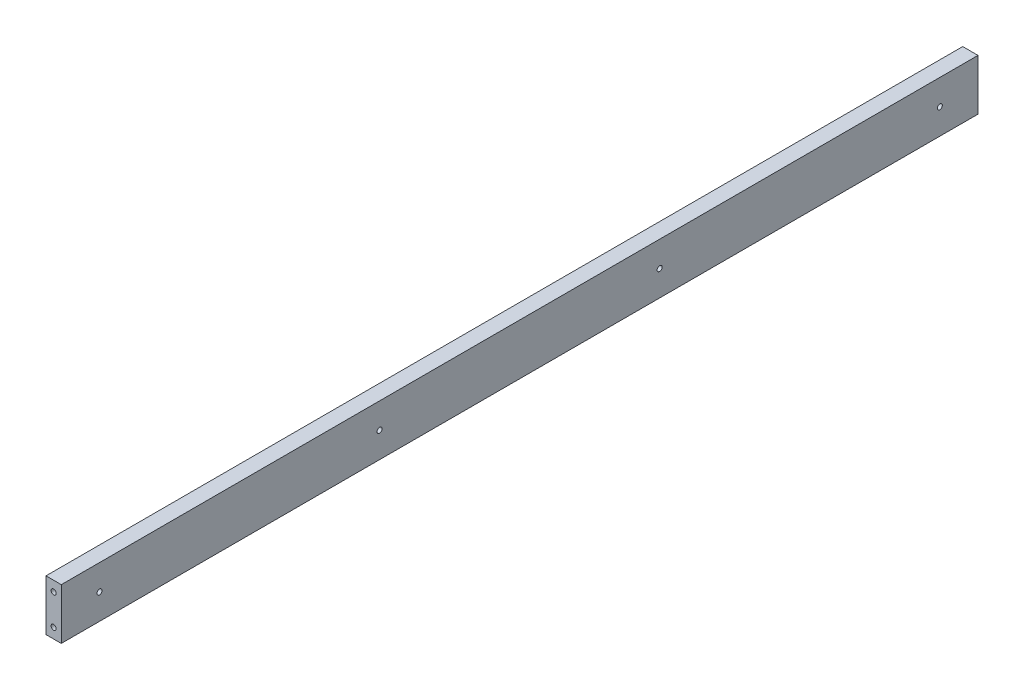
ISO-10303-21;
HEADER;
FILE_DESCRIPTION(('STEP AP214'),'2;1');
FILE_NAME('part.step','',(''),(''),'','','');
FILE_SCHEMA(('AUTOMOTIVE_DESIGN { 1 0 10303 214 1 1 1 1 }'));
ENDSEC;
DATA;
#1=APPLICATION_CONTEXT('core data for automotive mechanical design processes');
#2=APPLICATION_PROTOCOL_DEFINITION('international standard','automotive_design',2000,#1);
#3=PRODUCT_CONTEXT('',#1,'mechanical');
#4=PRODUCT('Part','Part','',(#3));
#5=PRODUCT_RELATED_PRODUCT_CATEGORY('part','',(#4));
#6=PRODUCT_DEFINITION_FORMATION('','',#4);
#7=PRODUCT_DEFINITION_CONTEXT('part definition',#1,'design');
#8=PRODUCT_DEFINITION('design','',#6,#7);
#9=PRODUCT_DEFINITION_SHAPE('','',#8);
#10=(LENGTH_UNIT() NAMED_UNIT(*) SI_UNIT(.MILLI.,.METRE.));
#11=(NAMED_UNIT(*) PLANE_ANGLE_UNIT() SI_UNIT($,.RADIAN.));
#12=(NAMED_UNIT(*) SI_UNIT($,.STERADIAN.) SOLID_ANGLE_UNIT());
#13=UNCERTAINTY_MEASURE_WITH_UNIT(LENGTH_MEASURE(1.E-05),#10,'distance_accuracy_value','');
#14=(GEOMETRIC_REPRESENTATION_CONTEXT(3) GLOBAL_UNCERTAINTY_ASSIGNED_CONTEXT((#13)) GLOBAL_UNIT_ASSIGNED_CONTEXT((#10,
#11,#12)) REPRESENTATION_CONTEXT('',''));
#15=CARTESIAN_POINT('',(0.,0.,0.));
#16=DIRECTION('',(0.,0.,1.));
#17=DIRECTION('',(1.,0.,0.));
#18=AXIS2_PLACEMENT_3D('',#15,#16,#17);
#19=CARTESIAN_POINT('',(0.,0.,-450.));
#20=DIRECTION('',(-1.,0.,0.));
#21=DIRECTION('',(0.,0.,1.));
#22=AXIS2_PLACEMENT_3D('',#19,#20,#21);
#23=PLANE('',#22);
#24=CARTESIAN_POINT('',(0.,25.,-137.5));
#25=DIRECTION('',(1.,0.,0.));
#26=DIRECTION('',(0.,0.,-1.));
#27=AXIS2_PLACEMENT_3D('',#24,#25,#26);
#28=CIRCLE('',#27,2.5);
#29=CARTESIAN_POINT('',(0.,25.,-140.));
#30=VERTEX_POINT('',#29);
#31=EDGE_CURVE('E207',#30,#30,#28,.T.);
#32=ORIENTED_EDGE('',*,*,#31,.T.);
#33=EDGE_LOOP('',(#32));
#34=FACE_BOUND('',#33,.T.);
#35=CARTESIAN_POINT('',(0.,25.,412.5));
#36=DIRECTION('',(1.,0.,0.));
#37=DIRECTION('',(0.,0.,-1.));
#38=AXIS2_PLACEMENT_3D('',#35,#36,#37);
#39=CIRCLE('',#38,2.5);
#40=CARTESIAN_POINT('',(0.,25.,410.));
#41=VERTEX_POINT('',#40);
#42=EDGE_CURVE('E211',#41,#41,#39,.T.);
#43=ORIENTED_EDGE('',*,*,#42,.T.);
#44=EDGE_LOOP('',(#43));
#45=FACE_BOUND('',#44,.T.);
#46=CARTESIAN_POINT('',(0.,25.,137.5));
#47=DIRECTION('',(1.,0.,0.));
#48=DIRECTION('',(0.,0.,-1.));
#49=AXIS2_PLACEMENT_3D('',#46,#47,#48);
#50=CIRCLE('',#49,2.5);
#51=CARTESIAN_POINT('',(0.,25.,135.));
#52=VERTEX_POINT('',#51);
#53=EDGE_CURVE('E215',#52,#52,#50,.T.);
#54=ORIENTED_EDGE('',*,*,#53,.T.);
#55=EDGE_LOOP('',(#54));
#56=FACE_BOUND('',#55,.T.);
#57=CARTESIAN_POINT('',(0.,25.,-412.5));
#58=DIRECTION('',(1.,0.,0.));
#59=DIRECTION('',(0.,0.,-1.));
#60=AXIS2_PLACEMENT_3D('',#57,#58,#59);
#61=CIRCLE('',#60,2.5);
#62=CARTESIAN_POINT('',(0.,25.,-415.));
#63=VERTEX_POINT('',#62);
#64=EDGE_CURVE('E116',#63,#63,#61,.T.);
#65=ORIENTED_EDGE('',*,*,#64,.T.);
#66=EDGE_LOOP('',(#65));
#67=FACE_BOUND('',#66,.T.);
#68=DIRECTION('',(0.,-1.,0.));
#69=VECTOR('',#68,1.);
#70=CARTESIAN_POINT('',(0.,0.,450.));
#71=LINE('',#70,#69);
#72=CARTESIAN_POINT('',(0.,50.,450.));
#73=VERTEX_POINT('',#72);
#74=CARTESIAN_POINT('',(0.,0.,450.));
#75=VERTEX_POINT('',#74);
#76=EDGE_CURVE('E143',#73,#75,#71,.T.);
#77=ORIENTED_EDGE('',*,*,#76,.F.);
#78=DIRECTION('',(0.,0.,1.));
#79=VECTOR('',#78,1.);
#80=CARTESIAN_POINT('',(0.,50.,-450.));
#81=LINE('',#80,#79);
#82=CARTESIAN_POINT('',(0.,50.,-450.));
#83=VERTEX_POINT('',#82);
#84=EDGE_CURVE('E11',#83,#73,#81,.T.);
#85=ORIENTED_EDGE('',*,*,#84,.F.);
#86=DIRECTION('',(0.,-1.,0.));
#87=VECTOR('',#86,1.);
#88=CARTESIAN_POINT('',(0.,0.,-450.));
#89=LINE('',#88,#87);
#90=CARTESIAN_POINT('',(0.,0.,-450.));
#91=VERTEX_POINT('',#90);
#92=EDGE_CURVE('E159',#83,#91,#89,.T.);
#93=ORIENTED_EDGE('',*,*,#92,.T.);
#94=DIRECTION('',(0.,0.,1.));
#95=VECTOR('',#94,1.);
#96=CARTESIAN_POINT('',(0.,0.,-450.));
#97=LINE('',#96,#95);
#98=EDGE_CURVE('E45',#91,#75,#97,.T.);
#99=ORIENTED_EDGE('',*,*,#98,.T.);
#100=EDGE_LOOP('',(#77,#85,#93,#99));
#101=FACE_BOUND('',#100,.T.);
#102=ADVANCED_FACE('F42',(#34,#45,#56,#67,#101),#23,.T.);
#103=CARTESIAN_POINT('',(0.,50.,-450.));
#104=DIRECTION('',(0.,1.,0.));
#105=DIRECTION('',(0.,0.,1.));
#106=AXIS2_PLACEMENT_3D('',#103,#104,#105);
#107=PLANE('',#106);
#108=DIRECTION('',(-1.,0.,0.));
#109=VECTOR('',#108,1.);
#110=CARTESIAN_POINT('',(0.,50.,450.));
#111=LINE('',#110,#109);
#112=CARTESIAN_POINT('',(15.,50.,450.));
#113=VERTEX_POINT('',#112);
#114=EDGE_CURVE('E155',#113,#73,#111,.T.);
#115=ORIENTED_EDGE('',*,*,#114,.F.);
#116=DIRECTION('',(0.,0.,1.));
#117=VECTOR('',#116,1.);
#118=CARTESIAN_POINT('',(15.,50.,-450.));
#119=LINE('',#118,#117);
#120=CARTESIAN_POINT('',(15.,50.,-450.));
#121=VERTEX_POINT('',#120);
#122=EDGE_CURVE('E51',#121,#113,#119,.T.);
#123=ORIENTED_EDGE('',*,*,#122,.F.);
#124=DIRECTION('',(-1.,0.,0.));
#125=VECTOR('',#124,1.);
#126=CARTESIAN_POINT('',(0.,50.,-450.));
#127=LINE('',#126,#125);
#128=EDGE_CURVE('E169',#121,#83,#127,.T.);
#129=ORIENTED_EDGE('',*,*,#128,.T.);
#130=ORIENTED_EDGE('',*,*,#84,.T.);
#131=EDGE_LOOP('',(#115,#123,#129,#130));
#132=FACE_BOUND('',#131,.T.);
#133=ADVANCED_FACE('F183',(#132),#107,.T.);
#134=CARTESIAN_POINT('',(15.,0.,-450.));
#135=DIRECTION('',(1.,0.,0.));
#136=DIRECTION('',(0.,0.,-1.));
#137=AXIS2_PLACEMENT_3D('',#134,#135,#136);
#138=PLANE('',#137);
#139=CARTESIAN_POINT('',(15.,25.,-137.5));
#140=DIRECTION('',(1.,0.,0.));
#141=DIRECTION('',(0.,0.,-1.));
#142=AXIS2_PLACEMENT_3D('',#139,#140,#141);
#143=CIRCLE('',#142,2.49999999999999);
#144=CARTESIAN_POINT('',(15.,25.,-140.));
#145=VERTEX_POINT('',#144);
#146=EDGE_CURVE('E232',#145,#145,#143,.T.);
#147=ORIENTED_EDGE('',*,*,#146,.F.);
#148=EDGE_LOOP('',(#147));
#149=FACE_BOUND('',#148,.T.);
#150=CARTESIAN_POINT('',(15.,25.,412.5));
#151=DIRECTION('',(1.,0.,0.));
#152=DIRECTION('',(0.,0.,-1.));
#153=AXIS2_PLACEMENT_3D('',#150,#151,#152);
#154=CIRCLE('',#153,2.49999999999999);
#155=CARTESIAN_POINT('',(15.,25.,410.));
#156=VERTEX_POINT('',#155);
#157=EDGE_CURVE('E228',#156,#156,#154,.T.);
#158=ORIENTED_EDGE('',*,*,#157,.F.);
#159=EDGE_LOOP('',(#158));
#160=FACE_BOUND('',#159,.T.);
#161=CARTESIAN_POINT('',(15.,25.,137.5));
#162=DIRECTION('',(1.,0.,0.));
#163=DIRECTION('',(0.,0.,-1.));
#164=AXIS2_PLACEMENT_3D('',#161,#162,#163);
#165=CIRCLE('',#164,2.49999999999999);
#166=CARTESIAN_POINT('',(15.,25.,135.));
#167=VERTEX_POINT('',#166);
#168=EDGE_CURVE('E220',#167,#167,#165,.T.);
#169=ORIENTED_EDGE('',*,*,#168,.F.);
#170=EDGE_LOOP('',(#169));
#171=FACE_BOUND('',#170,.T.);
#172=CARTESIAN_POINT('',(15.,25.,-412.5));
#173=DIRECTION('',(1.,0.,0.));
#174=DIRECTION('',(0.,0.,-1.));
#175=AXIS2_PLACEMENT_3D('',#172,#173,#174);
#176=CIRCLE('',#175,2.49999999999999);
#177=CARTESIAN_POINT('',(15.,25.,-415.));
#178=VERTEX_POINT('',#177);
#179=EDGE_CURVE('E106',#178,#178,#176,.T.);
#180=ORIENTED_EDGE('',*,*,#179,.F.);
#181=EDGE_LOOP('',(#180));
#182=FACE_BOUND('',#181,.T.);
#183=DIRECTION('',(0.,1.,0.));
#184=VECTOR('',#183,1.);
#185=CARTESIAN_POINT('',(15.,0.,450.));
#186=LINE('',#185,#184);
#187=CARTESIAN_POINT('',(15.,0.,450.));
#188=VERTEX_POINT('',#187);
#189=EDGE_CURVE('E151',#188,#113,#186,.T.);
#190=ORIENTED_EDGE('',*,*,#189,.F.);
#191=DIRECTION('',(0.,0.,1.));
#192=VECTOR('',#191,1.);
#193=CARTESIAN_POINT('',(15.,0.,-450.));
#194=LINE('',#193,#192);
#195=CARTESIAN_POINT('',(15.,0.,-450.));
#196=VERTEX_POINT('',#195);
#197=EDGE_CURVE('E172',#196,#188,#194,.T.);
#198=ORIENTED_EDGE('',*,*,#197,.F.);
#199=DIRECTION('',(0.,1.,0.));
#200=VECTOR('',#199,1.);
#201=CARTESIAN_POINT('',(15.,0.,-450.));
#202=LINE('',#201,#200);
#203=EDGE_CURVE('E166',#196,#121,#202,.T.);
#204=ORIENTED_EDGE('',*,*,#203,.T.);
#205=ORIENTED_EDGE('',*,*,#122,.T.);
#206=EDGE_LOOP('',(#190,#198,#204,#205));
#207=FACE_BOUND('',#206,.T.);
#208=ADVANCED_FACE('F189',(#149,#160,#171,#182,#207),#138,.T.);
#209=CARTESIAN_POINT('',(0.,0.,-450.));
#210=DIRECTION('',(0.,-1.,0.));
#211=DIRECTION('',(0.,0.,-1.));
#212=AXIS2_PLACEMENT_3D('',#209,#210,#211);
#213=PLANE('',#212);
#214=DIRECTION('',(1.,0.,0.));
#215=VECTOR('',#214,1.);
#216=CARTESIAN_POINT('',(0.,0.,450.));
#217=LINE('',#216,#215);
#218=EDGE_CURVE('E147',#75,#188,#217,.T.);
#219=ORIENTED_EDGE('',*,*,#218,.F.);
#220=ORIENTED_EDGE('',*,*,#98,.F.);
#221=DIRECTION('',(1.,0.,0.));
#222=VECTOR('',#221,1.);
#223=CARTESIAN_POINT('',(0.,0.,-450.));
#224=LINE('',#223,#222);
#225=EDGE_CURVE('E162',#91,#196,#224,.T.);
#226=ORIENTED_EDGE('',*,*,#225,.T.);
#227=ORIENTED_EDGE('',*,*,#197,.T.);
#228=EDGE_LOOP('',(#219,#220,#226,#227));
#229=FACE_BOUND('',#228,.T.);
#230=ADVANCED_FACE('F180',(#229),#213,.T.);
#231=CARTESIAN_POINT('',(0.,50.,-450.));
#232=DIRECTION('',(0.,0.,-1.));
#233=DIRECTION('',(-1.,0.,0.));
#234=AXIS2_PLACEMENT_3D('',#231,#232,#233);
#235=PLANE('',#234);
#236=CARTESIAN_POINT('',(7.5,40.,-450.));
#237=DIRECTION('',(0.,0.,-1.));
#238=DIRECTION('',(-1.,0.,0.));
#239=AXIS2_PLACEMENT_3D('',#236,#237,#238);
#240=CIRCLE('',#239,2.5);
#241=CARTESIAN_POINT('',(5.,40.,-450.));
#242=VERTEX_POINT('',#241);
#243=EDGE_CURVE('E105',#242,#242,#240,.T.);
#244=ORIENTED_EDGE('',*,*,#243,.F.);
#245=EDGE_LOOP('',(#244));
#246=FACE_BOUND('',#245,.T.);
#247=CARTESIAN_POINT('',(7.5,10.,-450.));
#248=DIRECTION('',(0.,0.,-1.));
#249=DIRECTION('',(-1.,0.,0.));
#250=AXIS2_PLACEMENT_3D('',#247,#248,#249);
#251=CIRCLE('',#250,2.5);
#252=CARTESIAN_POINT('',(5.,10.,-450.));
#253=VERTEX_POINT('',#252);
#254=EDGE_CURVE('E123',#253,#253,#251,.T.);
#255=ORIENTED_EDGE('',*,*,#254,.F.);
#256=EDGE_LOOP('',(#255));
#257=FACE_BOUND('',#256,.T.);
#258=ORIENTED_EDGE('',*,*,#92,.F.);
#259=ORIENTED_EDGE('',*,*,#128,.F.);
#260=ORIENTED_EDGE('',*,*,#203,.F.);
#261=ORIENTED_EDGE('',*,*,#225,.F.);
#262=EDGE_LOOP('',(#258,#259,#260,#261));
#263=FACE_BOUND('',#262,.T.);
#264=ADVANCED_FACE('F187',(#246,#257,#263),#235,.T.);
#265=CARTESIAN_POINT('',(0.,50.,450.));
#266=DIRECTION('',(0.,0.,-1.));
#267=DIRECTION('',(-1.,0.,0.));
#268=AXIS2_PLACEMENT_3D('',#265,#266,#267);
#269=PLANE('',#268);
#270=CARTESIAN_POINT('',(7.5,40.,450.));
#271=DIRECTION('',(0.,0.,1.));
#272=DIRECTION('',(1.,0.,0.));
#273=AXIS2_PLACEMENT_3D('',#270,#271,#272);
#274=CIRCLE('',#273,2.5);
#275=CARTESIAN_POINT('',(10.,40.,450.));
#276=VERTEX_POINT('',#275);
#277=EDGE_CURVE('E131',#276,#276,#274,.T.);
#278=ORIENTED_EDGE('',*,*,#277,.F.);
#279=EDGE_LOOP('',(#278));
#280=FACE_BOUND('',#279,.T.);
#281=CARTESIAN_POINT('',(7.5,10.,450.));
#282=DIRECTION('',(0.,0.,1.));
#283=DIRECTION('',(1.,0.,0.));
#284=AXIS2_PLACEMENT_3D('',#281,#282,#283);
#285=CIRCLE('',#284,2.5);
#286=CARTESIAN_POINT('',(10.,10.,450.));
#287=VERTEX_POINT('',#286);
#288=EDGE_CURVE('E139',#287,#287,#285,.T.);
#289=ORIENTED_EDGE('',*,*,#288,.F.);
#290=EDGE_LOOP('',(#289));
#291=FACE_BOUND('',#290,.T.);
#292=ORIENTED_EDGE('',*,*,#76,.T.);
#293=ORIENTED_EDGE('',*,*,#218,.T.);
#294=ORIENTED_EDGE('',*,*,#189,.T.);
#295=ORIENTED_EDGE('',*,*,#114,.T.);
#296=EDGE_LOOP('',(#292,#293,#294,#295));
#297=FACE_BOUND('',#296,.T.);
#298=ADVANCED_FACE('F182',(#280,#291,#297),#269,.F.);
#299=CARTESIAN_POINT('',(7.5,10.,450.));
#300=DIRECTION('',(0.,0.,1.));
#301=DIRECTION('',(1.,0.,0.));
#302=AXIS2_PLACEMENT_3D('',#299,#300,#301);
#303=CYLINDRICAL_SURFACE('',#302,2.5);
#304=CARTESIAN_POINT('',(7.5,10.,434.));
#305=DIRECTION('',(0.,0.,1.));
#306=DIRECTION('',(1.,0.,0.));
#307=AXIS2_PLACEMENT_3D('',#304,#305,#306);
#308=CIRCLE('',#307,2.5);
#309=CARTESIAN_POINT('',(9.99999999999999,10.,434.));
#310=VERTEX_POINT('',#309);
#311=EDGE_CURVE('E135',#310,#310,#308,.T.);
#312=ORIENTED_EDGE('',*,*,#311,.F.);
#313=EDGE_LOOP('',(#312));
#314=FACE_BOUND('',#313,.T.);
#315=ORIENTED_EDGE('',*,*,#288,.T.);
#316=EDGE_LOOP('',(#315));
#317=FACE_BOUND('',#316,.T.);
#318=ADVANCED_FACE('F275',(#314,#317),#303,.F.);
#319=CARTESIAN_POINT('',(7.5,10.,434.));
#320=DIRECTION('',(0.,0.,1.));
#321=DIRECTION('',(1.,0.,0.));
#322=AXIS2_PLACEMENT_3D('',#319,#320,#321);
#323=CONICAL_SURFACE('',#322,2.5,1.02974425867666);
#324=CARTESIAN_POINT('',(7.49999999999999,10.,432.497848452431));
#325=VERTEX_POINT('',#324);
#326=VERTEX_LOOP('',#325);
#327=FACE_BOUND('',#326,.T.);
#328=ORIENTED_EDGE('',*,*,#311,.T.);
#329=EDGE_LOOP('',(#328));
#330=FACE_BOUND('',#329,.T.);
#331=ADVANCED_FACE('F271',(#327,#330),#323,.F.);
#332=CARTESIAN_POINT('',(7.5,40.,450.));
#333=DIRECTION('',(0.,0.,1.));
#334=DIRECTION('',(1.,0.,0.));
#335=AXIS2_PLACEMENT_3D('',#332,#333,#334);
#336=CYLINDRICAL_SURFACE('',#335,2.5);
#337=CARTESIAN_POINT('',(7.5,40.,434.));
#338=DIRECTION('',(0.,0.,1.));
#339=DIRECTION('',(1.,0.,0.));
#340=AXIS2_PLACEMENT_3D('',#337,#338,#339);
#341=CIRCLE('',#340,2.5);
#342=CARTESIAN_POINT('',(9.99999999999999,40.,434.));
#343=VERTEX_POINT('',#342);
#344=EDGE_CURVE('E127',#343,#343,#341,.T.);
#345=ORIENTED_EDGE('',*,*,#344,.F.);
#346=EDGE_LOOP('',(#345));
#347=FACE_BOUND('',#346,.T.);
#348=ORIENTED_EDGE('',*,*,#277,.T.);
#349=EDGE_LOOP('',(#348));
#350=FACE_BOUND('',#349,.T.);
#351=ADVANCED_FACE('F267',(#347,#350),#336,.F.);
#352=CARTESIAN_POINT('',(7.5,40.,434.));
#353=DIRECTION('',(0.,0.,1.));
#354=DIRECTION('',(1.,0.,0.));
#355=AXIS2_PLACEMENT_3D('',#352,#353,#354);
#356=CONICAL_SURFACE('',#355,2.5,1.02974425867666);
#357=CARTESIAN_POINT('',(7.49999999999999,40.,432.497848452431));
#358=VERTEX_POINT('',#357);
#359=VERTEX_LOOP('',#358);
#360=FACE_BOUND('',#359,.T.);
#361=ORIENTED_EDGE('',*,*,#344,.T.);
#362=EDGE_LOOP('',(#361));
#363=FACE_BOUND('',#362,.T.);
#364=ADVANCED_FACE('F263',(#360,#363),#356,.F.);
#365=CARTESIAN_POINT('',(7.5,10.,-450.));
#366=DIRECTION('',(0.,0.,-1.));
#367=DIRECTION('',(-1.,0.,0.));
#368=AXIS2_PLACEMENT_3D('',#365,#366,#367);
#369=CYLINDRICAL_SURFACE('',#368,2.5);
#370=CARTESIAN_POINT('',(7.5,10.,-434.));
#371=DIRECTION('',(0.,0.,-1.));
#372=DIRECTION('',(-1.,0.,0.));
#373=AXIS2_PLACEMENT_3D('',#370,#371,#372);
#374=CIRCLE('',#373,2.5);
#375=CARTESIAN_POINT('',(5.,10.,-434.));
#376=VERTEX_POINT('',#375);
#377=EDGE_CURVE('E112',#376,#376,#374,.T.);
#378=ORIENTED_EDGE('',*,*,#377,.F.);
#379=EDGE_LOOP('',(#378));
#380=FACE_BOUND('',#379,.T.);
#381=ORIENTED_EDGE('',*,*,#254,.T.);
#382=EDGE_LOOP('',(#381));
#383=FACE_BOUND('',#382,.T.);
#384=ADVANCED_FACE('F259',(#380,#383),#369,.F.);
#385=CARTESIAN_POINT('',(7.5,10.,-434.));
#386=DIRECTION('',(0.,0.,-1.));
#387=DIRECTION('',(-1.,0.,0.));
#388=AXIS2_PLACEMENT_3D('',#385,#386,#387);
#389=CONICAL_SURFACE('',#388,2.5,1.02974425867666);
#390=CARTESIAN_POINT('',(7.49999999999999,10.,-432.497848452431));
#391=VERTEX_POINT('',#390);
#392=VERTEX_LOOP('',#391);
#393=FACE_BOUND('',#392,.T.);
#394=ORIENTED_EDGE('',*,*,#377,.T.);
#395=EDGE_LOOP('',(#394));
#396=FACE_BOUND('',#395,.T.);
#397=ADVANCED_FACE('F256',(#393,#396),#389,.F.);
#398=CARTESIAN_POINT('',(7.5,40.,-450.));
#399=DIRECTION('',(0.,0.,-1.));
#400=DIRECTION('',(-1.,0.,0.));
#401=AXIS2_PLACEMENT_3D('',#398,#399,#400);
#402=CYLINDRICAL_SURFACE('',#401,2.5);
#403=CARTESIAN_POINT('',(7.5,40.,-434.));
#404=DIRECTION('',(0.,0.,-1.));
#405=DIRECTION('',(-1.,0.,0.));
#406=AXIS2_PLACEMENT_3D('',#403,#404,#405);
#407=CIRCLE('',#406,2.5);
#408=CARTESIAN_POINT('',(5.,40.,-434.));
#409=VERTEX_POINT('',#408);
#410=EDGE_CURVE('E102',#409,#409,#407,.T.);
#411=ORIENTED_EDGE('',*,*,#410,.F.);
#412=EDGE_LOOP('',(#411));
#413=FACE_BOUND('',#412,.T.);
#414=ORIENTED_EDGE('',*,*,#243,.T.);
#415=EDGE_LOOP('',(#414));
#416=FACE_BOUND('',#415,.T.);
#417=ADVANCED_FACE('F98',(#413,#416),#402,.F.);
#418=CARTESIAN_POINT('',(7.5,40.,-434.));
#419=DIRECTION('',(0.,0.,-1.));
#420=DIRECTION('',(-1.,0.,0.));
#421=AXIS2_PLACEMENT_3D('',#418,#419,#420);
#422=CONICAL_SURFACE('',#421,2.5,1.02974425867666);
#423=CARTESIAN_POINT('',(7.49999999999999,40.,-432.497848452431));
#424=VERTEX_POINT('',#423);
#425=VERTEX_LOOP('',#424);
#426=FACE_BOUND('',#425,.T.);
#427=ORIENTED_EDGE('',*,*,#410,.T.);
#428=EDGE_LOOP('',(#427));
#429=FACE_BOUND('',#428,.T.);
#430=ADVANCED_FACE('F94',(#426,#429),#422,.F.);
#431=CARTESIAN_POINT('',(15.,25.,-412.5));
#432=DIRECTION('',(1.,0.,0.));
#433=DIRECTION('',(0.,0.,-1.));
#434=AXIS2_PLACEMENT_3D('',#431,#432,#433);
#435=CYLINDRICAL_SURFACE('',#434,2.49999999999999);
#436=ORIENTED_EDGE('',*,*,#64,.F.);
#437=EDGE_LOOP('',(#436));
#438=FACE_BOUND('',#437,.T.);
#439=ORIENTED_EDGE('',*,*,#179,.T.);
#440=EDGE_LOOP('',(#439));
#441=FACE_BOUND('',#440,.T.);
#442=ADVANCED_FACE('F97',(#438,#441),#435,.F.);
#443=CARTESIAN_POINT('',(15.,25.,137.5));
#444=DIRECTION('',(1.,0.,0.));
#445=DIRECTION('',(0.,0.,-1.));
#446=AXIS2_PLACEMENT_3D('',#443,#444,#445);
#447=CYLINDRICAL_SURFACE('',#446,2.49999999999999);
#448=ORIENTED_EDGE('',*,*,#53,.F.);
#449=EDGE_LOOP('',(#448));
#450=FACE_BOUND('',#449,.T.);
#451=ORIENTED_EDGE('',*,*,#168,.T.);
#452=EDGE_LOOP('',(#451));
#453=FACE_BOUND('',#452,.T.);
#454=ADVANCED_FACE('F245',(#450,#453),#447,.F.);
#455=CARTESIAN_POINT('',(15.,25.,412.5));
#456=DIRECTION('',(1.,0.,0.));
#457=DIRECTION('',(0.,0.,-1.));
#458=AXIS2_PLACEMENT_3D('',#455,#456,#457);
#459=CYLINDRICAL_SURFACE('',#458,2.49999999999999);
#460=ORIENTED_EDGE('',*,*,#42,.F.);
#461=EDGE_LOOP('',(#460));
#462=FACE_BOUND('',#461,.T.);
#463=ORIENTED_EDGE('',*,*,#157,.T.);
#464=EDGE_LOOP('',(#463));
#465=FACE_BOUND('',#464,.T.);
#466=ADVANCED_FACE('F239',(#462,#465),#459,.F.);
#467=CARTESIAN_POINT('',(15.,25.,-137.5));
#468=DIRECTION('',(1.,0.,0.));
#469=DIRECTION('',(0.,0.,-1.));
#470=AXIS2_PLACEMENT_3D('',#467,#468,#469);
#471=CYLINDRICAL_SURFACE('',#470,2.49999999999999);
#472=ORIENTED_EDGE('',*,*,#31,.F.);
#473=EDGE_LOOP('',(#472));
#474=FACE_BOUND('',#473,.T.);
#475=ORIENTED_EDGE('',*,*,#146,.T.);
#476=EDGE_LOOP('',(#475));
#477=FACE_BOUND('',#476,.T.);
#478=ADVANCED_FACE('F237',(#474,#477),#471,.F.);
#479=CLOSED_SHELL('',(#102,#133,#208,#230,#264,#298,#318,#331,#351,#364,#384,#397,#417,#430,
#442,#454,#466,#478));
#480=MANIFOLD_SOLID_BREP('B2',#479);
#481=ADVANCED_BREP_SHAPE_REPRESENTATION('',(#18,#480),#14);
#482=SHAPE_DEFINITION_REPRESENTATION(#9,#481);
ENDSEC;
END-ISO-10303-21;
